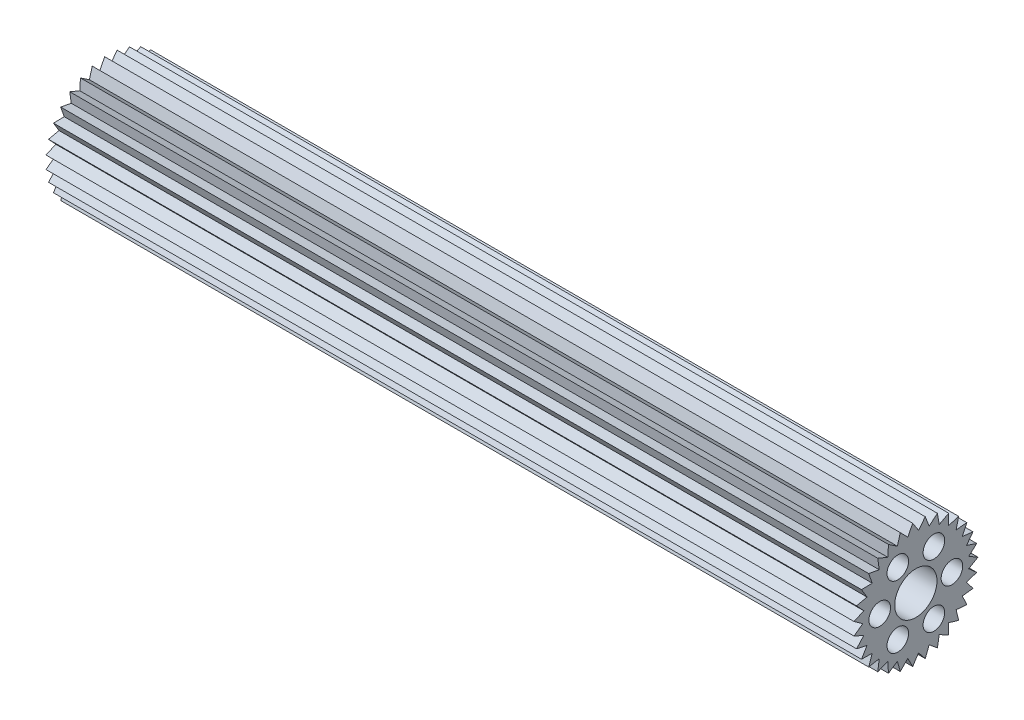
from build123d import *

# Parameters (mm, degrees)
SKETCH1_R           = 15
BOSS_EXTRUDE1_DEPTH = 200
SKETCH2_R           = 5
CUT_EXTRUDE1_DEPTH  = 250
CUT_EXTRUDE2_DEPTH  = 234
SKETCH7_R           = 2.602569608
SKETCH7_R_2         = 5.1
CUT_EXTRUDE3_DEPTH  = 272
SKETCH8_R           = 48.501819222
CUT_EXTRUDE4_DEPTH  = 5


with BuildPart() as part:
    # Sketch1 → Boss-Extrude1 (new body)
    with BuildSketch(Plane(origin=(0, 0, 0), x_dir=(0, 0, -1), z_dir=(1, 0, 0))):
        Circle(SKETCH1_R)
    extrude(amount=BOSS_EXTRUDE1_DEPTH)

    # Sketch2 → Cut-Extrude1 (cut)
    with BuildSketch(Plane(origin=(200, 0, 0), x_dir=(0, 0, -1), z_dir=(1, 0, 0))):
        Circle(SKETCH2_R)
    extrude(amount=-CUT_EXTRUDE1_DEPTH, mode=Mode.SUBTRACT)

    # Sketch6 → Cut-Extrude2 (cut)
    with BuildSketch(Plane.ZY):
        with BuildLine():
            Line((1.94121917, -12.671609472), (0.759737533, -14.980747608))
            ThreePointArc((0.759737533, -14.980747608), (2.271416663, -14.827024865), (3.759787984, -14.521156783))
            Line((3.759787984, -14.521156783), (1.94121917, -12.671609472))
        make_face()
        with BuildLine():
            Line((-0.649293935, -12.802985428), (-2.271416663, -14.827024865))
            ThreePointArc((-2.271416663, -14.827024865), (-0.759737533, -14.980747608), (0.759737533, -14.980747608))
            Line((0.759737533, -14.980747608), (-0.649293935, -12.802985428))
        make_face()
        with BuildLine():
            Line((-3.213224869, -12.410205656), (-5.209578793, -14.066281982))
            ThreePointArc((-5.209578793, -14.066281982), (-3.759787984, -14.521156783), (-2.271416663, -14.827024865))
            Line((-2.271416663, -14.827024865), (-3.213224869, -12.410205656))
        make_face()
        with BuildLine():
            Line((-5.645606, -11.509350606), (-7.934460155, -12.729663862))
            ThreePointArc((-7.934460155, -12.729663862), (-6.605912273, -13.467068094), (-5.209578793, -14.066281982))
            Line((-5.209578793, -14.066281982), (-5.645606, -11.509350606))
        make_face()
        with BuildLine():
            Line((-7.846855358, -10.137301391), (-10.334503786, -10.871891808))
            ThreePointArc((-10.334503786, -10.871891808), (-9.181589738, -11.861636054), (-7.934460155, -12.729663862))
            Line((-7.934460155, -12.729663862), (-7.846855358, -10.137301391))
        make_face()
        with BuildLine():
            Line((-9.726853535, -8.350229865), (-12.311451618, -8.569023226))
            ThreePointArc((-12.311451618, -8.569023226), (-11.38137184, -9.770587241), (-10.334503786, -10.871891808))
            Line((-10.334503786, -10.871891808), (-9.726853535, -8.350229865))
        make_face()
        with BuildLine():
            Line((-11.208633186, -6.221298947), (-13.784367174, -5.915337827))
            ThreePointArc((-13.784367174, -5.915337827), (-13.115199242, -7.279529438), (-12.311451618, -8.569023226))
            Line((-12.311451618, -8.569023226), (-11.208633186, -6.221298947))
        make_face()
        with BuildLine():
            Line((-12.231530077, -3.83766732), (-14.692949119, -3.019477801))
            ThreePointArc((-14.692949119, -3.019477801), (-14.312088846, -4.490446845), (-13.784367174, -5.915337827))
            Line((-13.784367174, -5.915337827), (-12.231530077, -3.83766732))
        make_face()
        with BuildLine():
            Line((-12.75366669, -1.296921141), (-15, 0))
            ThreePointArc((-15, 0), (-14.923039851, -1.51752483), (-14.692949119, -3.019477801))
            Line((-14.692949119, -3.019477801), (-12.75366669, -1.296921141))
        make_face()
        with BuildLine():
            Line((-12.75366669, 1.296921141), (-14.692949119, 3.019477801))
            ThreePointArc((-14.692949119, 3.019477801), (-14.923039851, 1.51752483), (-15, 0))
            Line((-15, 0), (-12.75366669, 1.296921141))
        make_face()
        with BuildLine():
            ThreePointArc((-13.784367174, 5.915337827), (-14.312088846, 4.490446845), (-14.692949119, 3.019477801))
            Line((-14.692949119, 3.019477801), (-12.231530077, 3.83766732))
            Line((-12.231530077, 3.83766732), (-13.784367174, 5.915337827))
        make_face()
        with BuildLine():
            ThreePointArc((-12.311451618, 8.569023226), (-13.115199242, 7.279529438), (-13.784367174, 5.915337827))
            Line((-13.784367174, 5.915337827), (-11.208633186, 6.221298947))
            Line((-11.208633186, 6.221298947), (-12.311451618, 8.569023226))
        make_face()
        with BuildLine():
            ThreePointArc((-10.334503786, 10.871891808), (-11.38137184, 9.770587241), (-12.311451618, 8.569023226))
            Line((-12.311451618, 8.569023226), (-9.726853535, 8.350229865))
            Line((-9.726853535, 8.350229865), (-10.334503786, 10.871891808))
        make_face()
        with BuildLine():
            ThreePointArc((-7.934460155, 12.729663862), (-9.181589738, 11.861636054), (-10.334503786, 10.871891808))
            Line((-10.334503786, 10.871891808), (-7.846855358, 10.137301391))
            Line((-7.846855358, 10.137301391), (-7.934460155, 12.729663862))
        make_face()
        with BuildLine():
            ThreePointArc((-5.209578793, 14.066281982), (-6.605912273, 13.467068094), (-7.934460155, 12.729663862))
            Line((-7.934460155, 12.729663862), (-5.645606, 11.509350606))
            Line((-5.645606, 11.509350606), (-5.209578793, 14.066281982))
        make_face()
        with BuildLine():
            ThreePointArc((-2.271416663, 14.827024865), (-3.759787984, 14.521156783), (-5.209578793, 14.066281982))
            Line((-5.209578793, 14.066281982), (-3.213224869, 12.410205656))
            Line((-3.213224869, 12.410205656), (-2.271416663, 14.827024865))
        make_face()
        with BuildLine():
            ThreePointArc((0.759737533, 14.980747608), (-0.759737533, 14.980747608), (-2.271416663, 14.827024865))
            Line((-2.271416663, 14.827024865), (-0.649293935, 12.802985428))
            Line((-0.649293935, 12.802985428), (0.759737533, 14.980747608))
        make_face()
        with BuildLine():
            ThreePointArc((3.759787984, 14.521156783), (2.271416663, 14.827024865), (0.759737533, 14.980747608))
            Line((0.759737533, 14.980747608), (1.94121917, 12.671609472))
            Line((1.94121917, 12.671609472), (3.759787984, 14.521156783))
        make_face()
        with BuildLine():
            ThreePointArc((6.605912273, 13.467068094), (5.209578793, 14.066281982), (3.759787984, 14.521156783))
            Line((3.759787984, 14.521156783), (4.452258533, 12.021456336))
            Line((4.452258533, 12.021456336), (6.605912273, 13.467068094))
        make_face()
        with BuildLine():
            ThreePointArc((9.181589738, 11.861636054), (7.934460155, 12.729663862), (6.605912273, 13.467068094))
            Line((6.605912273, 13.467068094), (6.781021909, 10.879143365))
            Line((6.781021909, 10.879143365), (9.181589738, 11.861636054))
        make_face()
        with BuildLine():
            ThreePointArc((11.38137184, 9.770587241), (10.334503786, 10.871891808), (9.181589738, 11.861636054))
            Line((9.181589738, 11.861636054), (8.832169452, 9.291436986))
            Line((8.832169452, 9.291436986), (11.38137184, 9.770587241))
        make_face()
        with BuildLine():
            ThreePointArc((13.115199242, 7.279529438), (12.311451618, 8.569023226), (11.38137184, 9.770587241))
            Line((11.38137184, 9.770587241), (10.521726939, 7.323338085))
            Line((10.521726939, 7.323338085), (13.115199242, 7.279529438))
        make_face()
        with BuildLine():
            ThreePointArc((14.312088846, 4.490446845), (13.784367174, 5.915337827), (13.115199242, 7.279529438))
            Line((13.115199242, 7.279529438), (11.780523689, 5.055420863))
            Line((11.780523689, 5.055420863), (14.312088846, 4.490446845))
        make_face()
        with BuildLine():
            ThreePointArc((14.923039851, 1.51752483), (14.692949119, 3.019477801), (14.312088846, 4.490446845))
            Line((14.312088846, 4.490446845), (12.557024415, 2.580534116))
            Line((12.557024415, 2.580534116), (14.923039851, 1.51752483))
        make_face()
        with BuildLine():
            ThreePointArc((15, 0), (14.980747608, 0.759737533), (14.923039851, 1.51752483))
            Line((14.923039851, 1.51752483), (12.819439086, 0))
            Line((12.819439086, 0), (14.923039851, -1.51752483))
            ThreePointArc((14.923039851, -1.51752483), (14.980747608, -0.759737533), (15, 0))
        make_face()
        with BuildLine():
            Line((12.557024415, -2.580534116), (14.312088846, -4.490446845))
            ThreePointArc((14.312088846, -4.490446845), (14.692949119, -3.019477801), (14.923039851, -1.51752483))
            Line((14.923039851, -1.51752483), (12.557024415, -2.580534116))
        make_face()
        with BuildLine():
            Line((11.780523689, -5.055420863), (13.115199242, -7.279529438))
            ThreePointArc((13.115199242, -7.279529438), (13.784367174, -5.915337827), (14.312088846, -4.490446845))
            Line((14.312088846, -4.490446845), (11.780523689, -5.055420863))
        make_face()
        with BuildLine():
            Line((10.521726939, -7.323338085), (11.38137184, -9.770587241))
            ThreePointArc((11.38137184, -9.770587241), (12.311451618, -8.569023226), (13.115199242, -7.279529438))
            Line((13.115199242, -7.279529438), (10.521726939, -7.323338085))
        make_face()
        with BuildLine():
            Line((8.832169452, -9.291436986), (9.181589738, -11.861636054))
            ThreePointArc((9.181589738, -11.861636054), (10.334503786, -10.871891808), (11.38137184, -9.770587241))
            Line((11.38137184, -9.770587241), (8.832169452, -9.291436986))
        make_face()
        with BuildLine():
            Line((6.781021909, -10.879143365), (6.605912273, -13.467068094))
            ThreePointArc((6.605912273, -13.467068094), (7.934460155, -12.729663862), (9.181589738, -11.861636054))
            Line((9.181589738, -11.861636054), (6.781021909, -10.879143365))
        make_face()
        with BuildLine():
            Line((4.452258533, -12.021456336), (3.759787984, -14.521156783))
            ThreePointArc((3.759787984, -14.521156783), (5.209578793, -14.066281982), (6.605912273, -13.467068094))
            Line((6.605912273, -13.467068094), (4.452258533, -12.021456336))
        make_face()
    extrude(amount=-CUT_EXTRUDE2_DEPTH, mode=Mode.SUBTRACT)

    # Sketch7 → Cut-Extrude3 (cut)
    with BuildSketch(Plane(origin=(200, 0, 0), x_dir=(0, 0, -1), z_dir=(1, 0, 0))):
        with Locations((-8.713094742, 0)):
            Circle(SKETCH7_R)
        with Locations((-4.356547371, 7.545761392)):
            Circle(SKETCH7_R)
        with Locations((4.356547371, 7.545761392)):
            Circle(SKETCH7_R)
        with Locations((8.713094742, 0)):
            Circle(SKETCH7_R)
        with Locations((4.356547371, -7.545761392)):
            Circle(SKETCH7_R)
        with Locations((-4.356547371, -7.545761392)):
            Circle(SKETCH7_R)
        Circle(SKETCH7_R_2)
    extrude(amount=-CUT_EXTRUDE3_DEPTH, mode=Mode.SUBTRACT)

    # Sketch8 → Cut-Extrude4 (cut)
    with BuildSketch(Plane(origin=(200, 0, 0), x_dir=(0, 0, -1), z_dir=(1, 0, 0))):
        with Locations((0.546633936, 0)):
            Circle(SKETCH8_R)
    extrude(amount=-CUT_EXTRUDE4_DEPTH, mode=Mode.SUBTRACT)


solid = part.part
